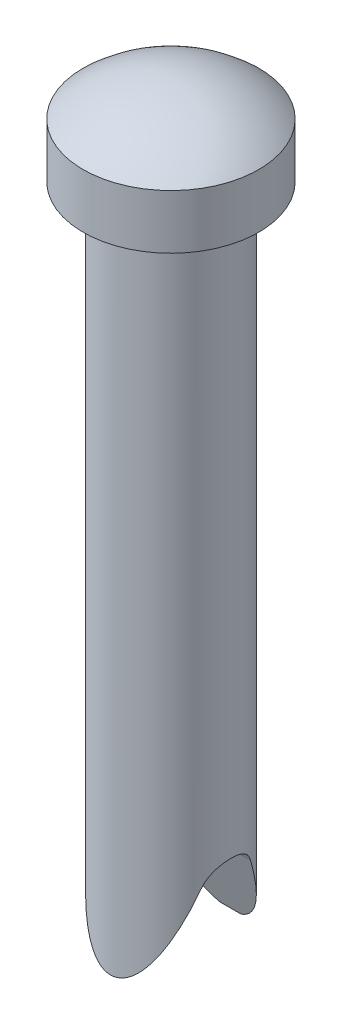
from build123d import *

# Parameters (mm, degrees)
SKETCH13_R              = 2.75
BOSS_EXTRUDE2_DEPTH     = 30
CUT_EXTRUDE1_DEPTH      = 31.528675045
CUT_EXTRUDE1_DEPTH_BACK = 31.528675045


with BuildPart() as part:
    # Sketch1 → Revolve2 (revolve)
    with BuildSketch(Plane.XY, mode=Mode.PRIVATE) as revolve2_sk:
        with BuildLine():
            Line((0, 4), (0, 0))
            Line((0, 0), (4, 0))
            Line((4, 0), (4, 2.472135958))
            ThreePointArc((4, 2.472135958), (2.141019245, 3.605001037), (0, 4))
        make_face()
    revolve(revolve2_sk.sketch.rotate(Axis((0, 0, 0), (0, -1, 0)), 180), axis=Axis((0, 0, 0), (0, -1, 0)))

    # Sketch13 → Boss-Extrude2 (add)
    with BuildSketch(Plane.XZ):
        Circle(SKETCH13_R)
    extrude(amount=BOSS_EXTRUDE2_DEPTH)

    # Sketch15 → Cut-Extrude1 (cut, two sides: drawn at the far end of the back side and taken through both)
    with BuildSketch(Plane(origin=(0, 0, 0), x_dir=(0, 0, -1), z_dir=(1, 0, 0)).offset(-CUT_EXTRUDE1_DEPTH_BACK)):
        with BuildLine():
            Line((-2.787110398, -30), (-1.112853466, -26.033338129))
            ThreePointArc((-1.112853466, -26.033338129), (0.000738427, -25.3), (1.104407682, -26.048188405))
            Line((1.104407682, -26.048188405), (2.710378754, -30))
            Line((2.710378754, -30), (-2.787110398, -30))
        make_face()
    extrude(amount=CUT_EXTRUDE1_DEPTH + CUT_EXTRUDE1_DEPTH_BACK, mode=Mode.SUBTRACT)


solid = part.part
